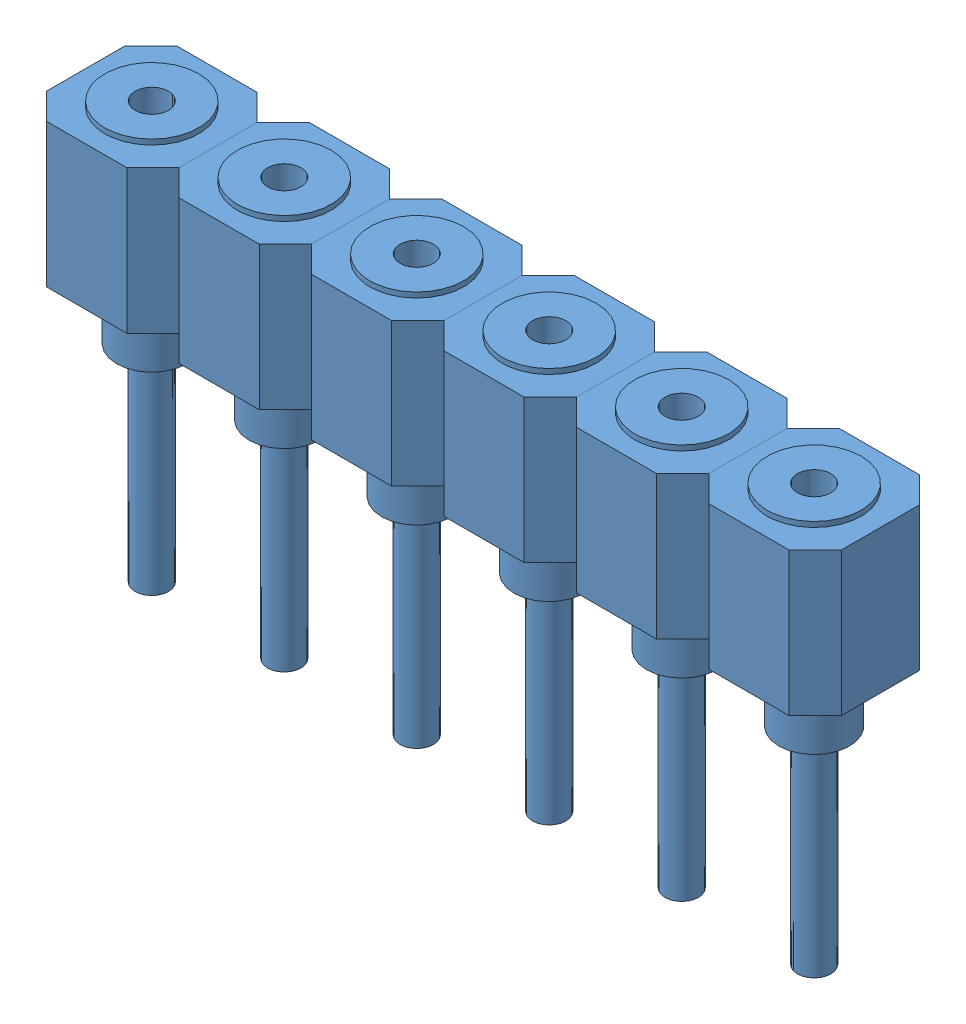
SolidWorks assembly Assemblage5.sldasm, configuration Défaut (file format 4700). Lengths in mm.
Overall size (15.24 7.99 2.5).
6 component instances, 1 part files, 0 mates.
Components (placement in the parent):
- Barette tulipe par 1-1: Barette tulipe par 1.SLDPRT [Défaut] at (-1.1906 0.497 0) size (2.54 7.99 2.5)
- Barette tulipe par 1-2: Barette tulipe par 1.SLDPRT [Défaut] at (1.3494 0.497 0) size (2.54 7.99 2.5)
- Barette tulipe par 1-3: Barette tulipe par 1.SLDPRT [Défaut] at (3.8894 0.497 0) size (2.54 7.99 2.5)
- Barette tulipe par 1-4: Barette tulipe par 1.SLDPRT [Défaut] at (6.4294 0.497 0) size (2.54 7.99 2.5)
- Barette tulipe par 1-5: Barette tulipe par 1.SLDPRT [Défaut] at (8.9694 0.497 0) size (2.54 7.99 2.5)
- Barette tulipe par 1-6: Barette tulipe par 1.SLDPRT [Défaut] at (11.5094 0.497 0) size (2.54 7.99 2.5)
